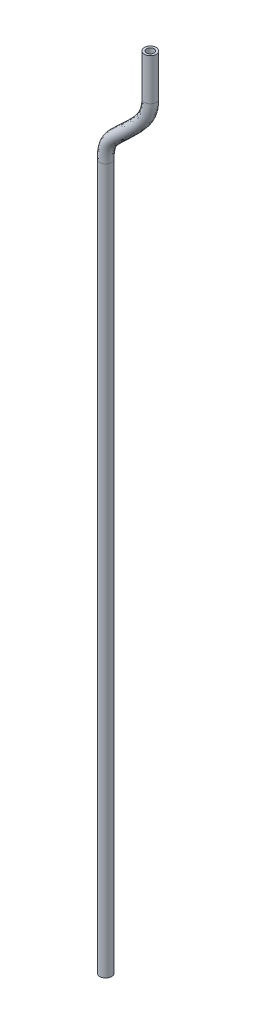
ISO-10303-21;
HEADER;
FILE_DESCRIPTION(('STEP AP214'),'2;1');
FILE_NAME('part.step','',(''),(''),'','','');
FILE_SCHEMA(('AUTOMOTIVE_DESIGN { 1 0 10303 214 1 1 1 1 }'));
ENDSEC;
DATA;
#1=APPLICATION_CONTEXT('core data for automotive mechanical design processes');
#2=APPLICATION_PROTOCOL_DEFINITION('international standard','automotive_design',2000,#1);
#3=PRODUCT_CONTEXT('',#1,'mechanical');
#4=PRODUCT('Part','Part','',(#3));
#5=PRODUCT_RELATED_PRODUCT_CATEGORY('part','',(#4));
#6=PRODUCT_DEFINITION_FORMATION('','',#4);
#7=PRODUCT_DEFINITION_CONTEXT('part definition',#1,'design');
#8=PRODUCT_DEFINITION('design','',#6,#7);
#9=PRODUCT_DEFINITION_SHAPE('','',#8);
#10=(LENGTH_UNIT() NAMED_UNIT(*) SI_UNIT(.MILLI.,.METRE.));
#11=(NAMED_UNIT(*) PLANE_ANGLE_UNIT() SI_UNIT($,.RADIAN.));
#12=(NAMED_UNIT(*) SI_UNIT($,.STERADIAN.) SOLID_ANGLE_UNIT());
#13=UNCERTAINTY_MEASURE_WITH_UNIT(LENGTH_MEASURE(1.E-05),#10,'distance_accuracy_value','');
#14=(GEOMETRIC_REPRESENTATION_CONTEXT(3) GLOBAL_UNCERTAINTY_ASSIGNED_CONTEXT((#13)) GLOBAL_UNIT_ASSIGNED_CONTEXT((#10,
#11,#12)) REPRESENTATION_CONTEXT('',''));
#15=CARTESIAN_POINT('',(0.,0.,0.));
#16=DIRECTION('',(0.,0.,1.));
#17=DIRECTION('',(1.,0.,0.));
#18=AXIS2_PLACEMENT_3D('',#15,#16,#17);
#19=CARTESIAN_POINT('',(18.,-24.,0.));
#20=DIRECTION('',(0.,1.,0.));
#21=DIRECTION('',(1.,0.,0.));
#22=AXIS2_PLACEMENT_3D('',#19,#20,#21);
#23=PLANE('',#22);
#24=CARTESIAN_POINT('',(18.,-24.,0.));
#25=DIRECTION('',(0.,1.,0.));
#26=DIRECTION('',(0.,0.,1.));
#27=AXIS2_PLACEMENT_3D('',#24,#25,#26);
#28=CIRCLE('',#27,1.25);
#29=CARTESIAN_POINT('',(18.,-24.,1.25));
#30=VERTEX_POINT('',#29);
#31=EDGE_CURVE('E10',#30,#30,#28,.T.);
#32=ORIENTED_EDGE('',*,*,#31,.F.);
#33=EDGE_LOOP('',(#32));
#34=FACE_BOUND('',#33,.T.);
#35=CARTESIAN_POINT('',(18.,-24.,0.));
#36=DIRECTION('',(0.,1.,0.));
#37=DIRECTION('',(0.,0.,1.));
#38=AXIS2_PLACEMENT_3D('',#35,#36,#37);
#39=CIRCLE('',#38,2.);
#40=CARTESIAN_POINT('',(18.,-24.,2.));
#41=VERTEX_POINT('',#40);
#42=EDGE_CURVE('E111',#41,#41,#39,.T.);
#43=ORIENTED_EDGE('',*,*,#42,.T.);
#44=EDGE_LOOP('',(#43));
#45=FACE_BOUND('',#44,.T.);
#46=ADVANCED_FACE('F16',(#34,#45),#23,.T.);
#47=CARTESIAN_POINT('',(18.,-29.7,0.));
#48=DIRECTION('',(0.,1.,0.));
#49=DIRECTION('',(0.,0.,1.));
#50=AXIS2_PLACEMENT_3D('',#47,#48,#49);
#51=CYLINDRICAL_SURFACE('',#50,1.25);
#52=DIRECTION('',(0.,1.,0.));
#53=VECTOR('',#52,1.);
#54=CARTESIAN_POINT('',(18.,-29.7,1.25));
#55=LINE('',#54,#53);
#56=CARTESIAN_POINT('',(18.,-29.5,1.25));
#57=VERTEX_POINT('',#56);
#58=EDGE_CURVE('E114',#57,#30,#55,.T.);
#59=ORIENTED_EDGE('',*,*,#58,.F.);
#60=CARTESIAN_POINT('',(18.,-29.5,0.));
#61=DIRECTION('',(0.,-1.,0.));
#62=DIRECTION('',(1.,0.,0.));
#63=AXIS2_PLACEMENT_3D('',#60,#61,#62);
#64=CIRCLE('',#63,1.25);
#65=CARTESIAN_POINT('',(19.25,-29.5,0.));
#66=VERTEX_POINT('',#65);
#67=EDGE_CURVE('E120',#66,#57,#64,.T.);
#68=ORIENTED_EDGE('',*,*,#67,.F.);
#69=DIRECTION('',(0.,1.,0.));
#70=VECTOR('',#69,1.);
#71=CARTESIAN_POINT('',(19.25,-38.,0.));
#72=LINE('',#71,#70);
#73=CARTESIAN_POINT('',(19.25,-38.,0.));
#74=VERTEX_POINT('',#73);
#75=EDGE_CURVE('E26',#74,#66,#72,.T.);
#76=ORIENTED_EDGE('',*,*,#75,.F.);
#77=CARTESIAN_POINT('',(18.,-38.,0.));
#78=DIRECTION('',(0.,-1.,0.));
#79=DIRECTION('',(1.,0.,0.));
#80=AXIS2_PLACEMENT_3D('',#77,#78,#79);
#81=CIRCLE('',#80,1.25);
#82=EDGE_CURVE('E112',#74,#74,#81,.T.);
#83=ORIENTED_EDGE('',*,*,#82,.T.);
#84=ORIENTED_EDGE('',*,*,#75,.T.);
#85=ORIENTED_EDGE('',*,*,#67,.T.);
#86=ORIENTED_EDGE('',*,*,#58,.T.);
#87=ORIENTED_EDGE('',*,*,#31,.T.);
#88=EDGE_LOOP('',(#59,#68,#76,#83,#84,#85,#86,#87));
#89=FACE_BOUND('',#88,.T.);
#90=ADVANCED_FACE('F184',(#89),#51,.F.);
#91=CARTESIAN_POINT('',(19.25,-38.,0.));
#92=CARTESIAN_POINT('',(19.25,-39.04061917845,0.));
#93=CARTESIAN_POINT('',(19.176588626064,-40.02053076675,0.));
#94=CARTESIAN_POINT('',(19.032744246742,-40.94499559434,0.));
#95=CARTESIAN_POINT('',(18.821214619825,-41.81850319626,0.));
#96=CARTESIAN_POINT('',(18.546278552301,-42.64317702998,0.));
#97=CARTESIAN_POINT('',(18.214390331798,-43.42062925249,0.));
#98=CARTESIAN_POINT('',(17.833687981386,-44.15416323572,0.));
#99=CARTESIAN_POINT('',(17.412683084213,-44.84960289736,0.));
#100=CARTESIAN_POINT('',(16.958786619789,-45.51440882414,0.));
#101=CARTESIAN_POINT('',(16.477661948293,-46.15612206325,0.));
#102=CARTESIAN_POINT('',(15.494803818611,-47.38034418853,0.));
#103=CARTESIAN_POINT('',(14.991513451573,-47.96858507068,0.));
#104=CARTESIAN_POINT('',(14.468585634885,-48.54782070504,0.));
#105=CARTESIAN_POINT('',(13.929660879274,-49.11842642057,0.));
#106=CARTESIAN_POINT('',(13.378336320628,-49.68064294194,0.));
#107=CARTESIAN_POINT('',(12.818198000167,-50.23460058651,0.));
#108=CARTESIAN_POINT('',(12.252845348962,-50.78033689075,0.));
#109=CARTESIAN_POINT('',(11.685907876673,-51.31780766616,0.));
#110=CARTESIAN_POINT('',(11.121054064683,-51.84689148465,0.));
#111=CARTESIAN_POINT('',(10.248312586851,-52.65942903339,0.));
#112=CARTESIAN_POINT('',(9.398805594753,-53.45033487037,0.));
#113=CARTESIAN_POINT('',(9.09713964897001,-53.7317529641,0.));
#114=CARTESIAN_POINT('',(8.799803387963,-54.01026278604,0.));
#115=CARTESIAN_POINT('',(8.50746884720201,-54.28579566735,0.));
#116=CARTESIAN_POINT('',(8.22081366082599,-54.55827085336,0.));
#117=CARTESIAN_POINT('',(7.940521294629,-54.82759231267,0.));
#118=CARTESIAN_POINT('',(7.667281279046,-55.09364554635,0.));
#119=CARTESIAN_POINT('',(7.40178944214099,-55.35629439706,0.));
#120=CARTESIAN_POINT('',(7.14474814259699,-55.61537785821,0.));
#121=CARTESIAN_POINT('',(6.433902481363,-56.34758024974,0.));
#122=CARTESIAN_POINT('',(6.016460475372,-56.79737856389,0.));
#123=CARTESIAN_POINT('',(5.649418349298,-57.23577662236,0.));
#124=CARTESIAN_POINT('',(5.331330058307,-57.67812289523,0.));
#125=CARTESIAN_POINT('',(5.066042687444,-58.1446807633,0.));
#126=CARTESIAN_POINT('',(4.823251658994,-58.6454171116,0.));
#127=CARTESIAN_POINT('',(4.607635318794,-59.25210226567,0.));
#128=CARTESIAN_POINT('',(4.436594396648,-59.96802918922,0.));
#129=CARTESIAN_POINT('',(4.314343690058,-60.8207659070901,0.));
#130=CARTESIAN_POINT('',(4.25,-61.8258066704,0.));
#131=CARTESIAN_POINT('',(4.25,-63.,0.));
#132=CARTESIAN_POINT('',(19.25,-38.,-2.076928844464));
#133=CARTESIAN_POINT('',(19.25,-39.04061917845,-2.076928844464));
#134=CARTESIAN_POINT('',(19.176588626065,-40.02053076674,-2.076928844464));
#135=CARTESIAN_POINT('',(19.032744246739,-40.94499559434,-2.076928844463));
#136=CARTESIAN_POINT('',(18.821214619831,-41.81850319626,-2.076928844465));
#137=CARTESIAN_POINT('',(18.546278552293,-42.64317702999,-2.076928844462));
#138=CARTESIAN_POINT('',(18.214390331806,-43.42062925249,-2.076928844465));
#139=CARTESIAN_POINT('',(17.833687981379,-44.15416323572,-2.076928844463));
#140=CARTESIAN_POINT('',(17.412683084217,-44.84960289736,-2.076928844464));
#141=CARTESIAN_POINT('',(16.958786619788,-45.51440882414,-2.076928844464));
#142=CARTESIAN_POINT('',(16.477661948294,-46.1561220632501,-2.076928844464));
#143=CARTESIAN_POINT('',(15.494803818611,-47.38034418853,-2.076928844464));
#144=CARTESIAN_POINT('',(14.991513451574,-47.96858507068,-2.076928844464));
#145=CARTESIAN_POINT('',(14.468585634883,-48.54782070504,-2.076928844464));
#146=CARTESIAN_POINT('',(13.929660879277,-49.11842642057,-2.076928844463));
#147=CARTESIAN_POINT('',(13.378336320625,-49.68064294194,-2.076928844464));
#148=CARTESIAN_POINT('',(12.81819800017,-50.23460058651,-2.076928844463));
#149=CARTESIAN_POINT('',(12.25284534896,-50.78033689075,-2.076928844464));
#150=CARTESIAN_POINT('',(11.685907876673,-51.31780766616,-2.076928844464));
#151=CARTESIAN_POINT('',(11.121054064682,-51.84689148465,-2.076928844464));
#152=CARTESIAN_POINT('',(10.248312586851,-52.65942903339,-2.076928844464));
#153=CARTESIAN_POINT('',(9.398805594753,-53.45033487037,-2.076928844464));
#154=CARTESIAN_POINT('',(9.09713964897,-53.7317529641,-2.076928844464));
#155=CARTESIAN_POINT('',(8.799803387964,-54.01026278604,-2.076928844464));
#156=CARTESIAN_POINT('',(8.507468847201,-54.28579566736,-2.076928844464));
#157=CARTESIAN_POINT('',(8.220813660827,-54.55827085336,-2.076928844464));
#158=CARTESIAN_POINT('',(7.940521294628,-54.82759231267,-2.076928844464));
#159=CARTESIAN_POINT('',(7.667281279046,-55.09364554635,-2.076928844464));
#160=CARTESIAN_POINT('',(7.401789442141,-55.3562943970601,-2.076928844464));
#161=CARTESIAN_POINT('',(7.144748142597,-55.61537785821,-2.076928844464));
#162=CARTESIAN_POINT('',(6.433902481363,-56.34758024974,-2.076928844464));
#163=CARTESIAN_POINT('',(6.016460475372,-56.79737856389,-2.076928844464));
#164=CARTESIAN_POINT('',(5.649418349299,-57.23577662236,-2.076928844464));
#165=CARTESIAN_POINT('',(5.331330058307,-57.67812289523,-2.076928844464));
#166=CARTESIAN_POINT('',(5.066042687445,-58.14468076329,-2.076928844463));
#167=CARTESIAN_POINT('',(4.823251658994,-58.64541711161,-2.076928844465));
#168=CARTESIAN_POINT('',(4.607635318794,-59.25210226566,-2.076928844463));
#169=CARTESIAN_POINT('',(4.43659439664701,-59.96802918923,-2.076928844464));
#170=CARTESIAN_POINT('',(4.314343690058,-60.82076590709,-2.076928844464));
#171=CARTESIAN_POINT('',(4.25,-61.8258066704,-2.076928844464));
#172=CARTESIAN_POINT('',(4.25,-63.,-2.076928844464));
#173=CARTESIAN_POINT('',(16.681814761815,-38.,-2.375140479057));
#174=CARTESIAN_POINT('',(16.681814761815,-38.87591478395,-2.375140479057));
#175=CARTESIAN_POINT('',(16.620022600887,-39.67769308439,-2.375140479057));
#176=CARTESIAN_POINT('',(16.502344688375,-40.4139002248,-2.375140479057));
#177=CARTESIAN_POINT('',(16.334930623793,-41.09391489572,-2.375140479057));
#178=CARTESIAN_POINT('',(16.122315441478,-41.72961093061,-2.375140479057));
#179=CARTESIAN_POINT('',(15.866740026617,-42.33340135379,-2.375140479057));
#180=CARTESIAN_POINT('',(15.568669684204,-42.9159157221,-2.375140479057));
#181=CARTESIAN_POINT('',(15.228175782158,-43.48512555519,-2.375140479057));
#182=CARTESIAN_POINT('',(14.846490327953,-44.04727642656,-2.375140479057));
#183=CARTESIAN_POINT('',(14.426688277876,-44.60852906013,-2.375140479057));
#184=CARTESIAN_POINT('',(13.538295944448,-45.71508708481,-2.375140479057));
#185=CARTESIAN_POINT('',(13.076511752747,-46.25534320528,-2.375140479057));
#186=CARTESIAN_POINT('',(12.590307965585,-46.79455019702,-2.375140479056));
#187=CARTESIAN_POINT('',(12.083335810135,-47.33190873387,-2.375140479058));
#188=CARTESIAN_POINT('',(11.559292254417,-47.8667614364,-2.375140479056));
#189=CARTESIAN_POINT('',(11.021885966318,-48.39856735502,-2.375140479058));
#190=CARTESIAN_POINT('',(10.474811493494,-48.92688338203,-2.375140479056));
#191=CARTESIAN_POINT('',(9.92173166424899,-49.45135259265,-2.375140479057));
#192=CARTESIAN_POINT('',(9.366268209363,-49.97169951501,-2.375140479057));
#193=CARTESIAN_POINT('',(8.501010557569,-50.77726949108,-2.375140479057));
#194=CARTESIAN_POINT('',(7.647304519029,-51.57208471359,-2.375140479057));
#195=CARTESIAN_POINT('',(7.342584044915,-51.85635283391,-2.375140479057));
#196=CARTESIAN_POINT('',(7.04060130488,-52.13920913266,-2.375140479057));
#197=CARTESIAN_POINT('',(6.741970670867,-52.42065474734,-2.375140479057));
#198=CARTESIAN_POINT('',(6.447300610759,-52.70070356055,-2.375140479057));
#199=CARTESIAN_POINT('',(6.15719344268,-52.97938556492,-2.375140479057));
#200=CARTESIAN_POINT('',(5.87224508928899,-53.2567502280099,-2.375140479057));
#201=CARTESIAN_POINT('',(5.5930448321,-53.53286985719,-2.375140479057));
#202=CARTESIAN_POINT('',(5.320175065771,-53.80784296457,-2.375140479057));
#203=CARTESIAN_POINT('',(4.557474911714,-54.59345777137,-2.375140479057));
#204=CARTESIAN_POINT('',(4.070516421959,-55.11630656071,-2.375140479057));
#205=CARTESIAN_POINT('',(3.597238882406,-55.67157998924,-2.375140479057));
#206=CARTESIAN_POINT('',(3.148214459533,-56.2808581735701,-2.375140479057));
#207=CARTESIAN_POINT('',(2.728433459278,-56.96053822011,-2.375140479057));
#208=CARTESIAN_POINT('',(2.378900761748,-57.73787538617,-2.375140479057));
#209=CARTESIAN_POINT('',(2.103730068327,-58.5749502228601,-2.375140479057));
#210=CARTESIAN_POINT('',(1.893618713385,-59.50605595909,-2.375140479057));
#211=CARTESIAN_POINT('',(1.753169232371,-60.53988660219,-2.375140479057));
#212=CARTESIAN_POINT('',(1.681814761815,-61.69786853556,-2.375140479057));
#213=CARTESIAN_POINT('',(1.681814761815,-63.,-2.375140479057));
#214=CARTESIAN_POINT('',(14.563603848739,-38.,0.));
#215=CARTESIAN_POINT('',(14.563603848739,-38.74006841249,0.));
#216=CARTESIAN_POINT('',(14.511395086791,-39.39492433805,0.));
#217=CARTESIAN_POINT('',(14.41529898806,-39.97585861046,0.));
#218=CARTESIAN_POINT('',(14.284270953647,-40.49628244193,0.));
#219=CARTESIAN_POINT('',(14.123057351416,-40.97611166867,0.));
#220=CARTESIAN_POINT('',(13.930423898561,-41.43666775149,0.));
#221=CARTESIAN_POINT('',(13.700507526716,-41.89462280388,0.));
#222=CARTESIAN_POINT('',(13.426418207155,-42.35971966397,0.));
#223=CARTESIAN_POINT('',(13.10429159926,-42.83720177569,0.));
#224=CARTESIAN_POINT('',(12.73506777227,-43.33209138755,0.));
#225=CARTESIAN_POINT('',(11.924589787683,-44.34160135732,0.));
#226=CARTESIAN_POINT('',(11.497039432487,-44.84228017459,0.));
#227=CARTESIAN_POINT('',(11.041125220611,-45.34847198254,0.));
#228=CARTESIAN_POINT('',(10.560507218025,-45.85840861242,0.));
#229=CARTESIAN_POINT('',(10.05896473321,-46.3706919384,0.));
#230=CARTESIAN_POINT('',(9.540307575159,-46.88422735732,0.));
#231=CARTESIAN_POINT('',(9.00830874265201,-47.39817533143,0.));
#232=CARTESIAN_POINT('',(8.466658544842,-47.91192099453,0.));
#233=CARTESIAN_POINT('',(7.918940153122,-48.42506182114,0.));
#234=CARTESIAN_POINT('',(7.05985507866,-49.22488501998,0.));
#235=CARTESIAN_POINT('',(6.202685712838,-50.02292466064,0.));
#236=CARTESIAN_POINT('',(5.89544589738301,-50.30954345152,0.));
#237=CARTESIAN_POINT('',(5.589630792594,-50.5959846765,0.));
#238=CARTESIAN_POINT('',(5.285807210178,-50.88230704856,0.));
#239=CARTESIAN_POINT('',(4.984526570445,-51.16860250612,0.));
#240=CARTESIAN_POINT('',(4.686324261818,-51.45500498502,0.));
#241=CARTESIAN_POINT('',(4.391719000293,-51.74169919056,0.));
#242=CARTESIAN_POINT('',(4.10121218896,-52.02892936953,0.));
#243=CARTESIAN_POINT('',(3.815287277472,-52.3170080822,0.));
#244=CARTESIAN_POINT('',(3.009818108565,-53.14667686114,0.));
#245=CARTESIAN_POINT('',(2.46552318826,-53.72977687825,0.));
#246=CARTESIAN_POINT('',(1.904623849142,-54.3814478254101,0.));
#247=CARTESIAN_POINT('',(1.347604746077,-55.1284096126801,0.));
#248=CARTESIAN_POINT('',(0.800399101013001,-55.98387048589,0.));
#249=CARTESIAN_POINT('',(0.362827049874,-56.98934496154,0.));
#250=CARTESIAN_POINT('',(0.03853658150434,-58.01644267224,0.));
#251=CARTESIAN_POINT('',(-0.203799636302,-59.12502552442,0.));
#252=CARTESIAN_POINT('',(-0.359259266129,-60.30822044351,0.));
#253=CARTESIAN_POINT('',(-0.436396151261,-61.59234657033,0.));
#254=CARTESIAN_POINT('',(-0.436396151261,-63.,0.));
#255=CARTESIAN_POINT('',(16.681814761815,-38.,2.375140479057));
#256=CARTESIAN_POINT('',(16.681814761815,-38.87591478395,2.375140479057));
#257=CARTESIAN_POINT('',(16.620022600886,-39.67769308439,2.375140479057));
#258=CARTESIAN_POINT('',(16.502344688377,-40.4139002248,2.375140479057));
#259=CARTESIAN_POINT('',(16.33493062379,-41.09391489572,2.375140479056));
#260=CARTESIAN_POINT('',(16.122315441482,-41.72961093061,2.375140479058));
#261=CARTESIAN_POINT('',(15.866740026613,-42.33340135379,2.375140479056));
#262=CARTESIAN_POINT('',(15.568669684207,-42.9159157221,2.375140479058));
#263=CARTESIAN_POINT('',(15.228175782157,-43.4851255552,2.375140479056));
#264=CARTESIAN_POINT('',(14.846490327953,-44.04727642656,2.375140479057));
#265=CARTESIAN_POINT('',(14.426688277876,-44.60852906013,2.375140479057));
#266=CARTESIAN_POINT('',(13.538295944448,-45.71508708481,2.375140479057));
#267=CARTESIAN_POINT('',(13.076511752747,-46.25534320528,2.375140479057));
#268=CARTESIAN_POINT('',(12.590307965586,-46.79455019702,2.375140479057));
#269=CARTESIAN_POINT('',(12.083335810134,-47.33190873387,2.375140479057));
#270=CARTESIAN_POINT('',(11.559292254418,-47.8667614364,2.375140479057));
#271=CARTESIAN_POINT('',(11.021885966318,-48.39856735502,2.375140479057));
#272=CARTESIAN_POINT('',(10.474811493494,-48.92688338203,2.375140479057));
#273=CARTESIAN_POINT('',(9.92173166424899,-49.45135259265,2.375140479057));
#274=CARTESIAN_POINT('',(9.366268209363,-49.97169951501,2.375140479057));
#275=CARTESIAN_POINT('',(8.501010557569,-50.77726949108,2.375140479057));
#276=CARTESIAN_POINT('',(7.647304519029,-51.57208471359,2.375140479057));
#277=CARTESIAN_POINT('',(7.342584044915,-51.85635283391,2.375140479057));
#278=CARTESIAN_POINT('',(7.04060130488,-52.13920913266,2.375140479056));
#279=CARTESIAN_POINT('',(6.741970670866,-52.42065474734,2.375140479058));
#280=CARTESIAN_POINT('',(6.44730061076,-52.70070356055,2.375140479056));
#281=CARTESIAN_POINT('',(6.157193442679,-52.97938556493,2.375140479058));
#282=CARTESIAN_POINT('',(5.87224508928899,-53.2567502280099,2.375140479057));
#283=CARTESIAN_POINT('',(5.5930448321,-53.53286985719,2.375140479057));
#284=CARTESIAN_POINT('',(5.32017506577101,-53.80784296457,2.375140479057));
#285=CARTESIAN_POINT('',(4.557474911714,-54.59345777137,2.375140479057));
#286=CARTESIAN_POINT('',(4.07051642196,-55.11630656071,2.375140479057));
#287=CARTESIAN_POINT('',(3.597238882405,-55.67157998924,2.375140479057));
#288=CARTESIAN_POINT('',(3.148214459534,-56.2808581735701,2.375140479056));
#289=CARTESIAN_POINT('',(2.728433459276,-56.96053822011,2.375140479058));
#290=CARTESIAN_POINT('',(2.37890076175,-57.73787538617,2.375140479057));
#291=CARTESIAN_POINT('',(2.103730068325,-58.5749502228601,2.375140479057));
#292=CARTESIAN_POINT('',(1.893618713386,-59.50605595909,2.375140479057));
#293=CARTESIAN_POINT('',(1.75316923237,-60.53988660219,2.375140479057));
#294=CARTESIAN_POINT('',(1.681814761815,-61.69786853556,2.375140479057));
#295=CARTESIAN_POINT('',(1.681814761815,-63.,2.375140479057));
#296=CARTESIAN_POINT('',(19.25,-38.,2.076928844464));
#297=CARTESIAN_POINT('',(19.25,-39.04061917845,2.076928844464));
#298=CARTESIAN_POINT('',(19.176588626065,-40.02053076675,2.076928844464));
#299=CARTESIAN_POINT('',(19.032744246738,-40.94499559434,2.076928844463));
#300=CARTESIAN_POINT('',(18.821214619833,-41.81850319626,2.076928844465));
#301=CARTESIAN_POINT('',(18.546278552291,-42.64317702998,2.076928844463));
#302=CARTESIAN_POINT('',(18.214390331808,-43.42062925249,2.076928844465));
#303=CARTESIAN_POINT('',(17.833687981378,-44.15416323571,2.076928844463));
#304=CARTESIAN_POINT('',(17.412683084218,-44.84960289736,2.076928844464));
#305=CARTESIAN_POINT('',(16.958786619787,-45.51440882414,2.076928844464));
#306=CARTESIAN_POINT('',(16.477661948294,-46.1561220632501,2.076928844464));
#307=CARTESIAN_POINT('',(15.494803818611,-47.38034418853,2.076928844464));
#308=CARTESIAN_POINT('',(14.991513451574,-47.96858507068,2.076928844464));
#309=CARTESIAN_POINT('',(14.468585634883,-48.54782070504,2.076928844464));
#310=CARTESIAN_POINT('',(13.929660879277,-49.11842642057,2.076928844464));
#311=CARTESIAN_POINT('',(13.378336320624,-49.68064294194,2.076928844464));
#312=CARTESIAN_POINT('',(12.818198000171,-50.23460058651,2.076928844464));
#313=CARTESIAN_POINT('',(12.25284534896,-50.78033689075,2.076928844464));
#314=CARTESIAN_POINT('',(11.685907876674,-51.31780766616,2.076928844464));
#315=CARTESIAN_POINT('',(11.121054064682,-51.84689148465,2.076928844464));
#316=CARTESIAN_POINT('',(10.248312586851,-52.65942903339,2.076928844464));
#317=CARTESIAN_POINT('',(9.398805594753,-53.45033487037,2.076928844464));
#318=CARTESIAN_POINT('',(9.09713964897,-53.7317529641,2.076928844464));
#319=CARTESIAN_POINT('',(8.799803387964,-54.01026278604,2.076928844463));
#320=CARTESIAN_POINT('',(8.507468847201,-54.28579566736,2.076928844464));
#321=CARTESIAN_POINT('',(8.22081366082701,-54.55827085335,2.076928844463));
#322=CARTESIAN_POINT('',(7.940521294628,-54.82759231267,2.076928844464));
#323=CARTESIAN_POINT('',(7.667281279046,-55.09364554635,2.076928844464));
#324=CARTESIAN_POINT('',(7.401789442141,-55.3562943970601,2.076928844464));
#325=CARTESIAN_POINT('',(7.144748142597,-55.61537785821,2.076928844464));
#326=CARTESIAN_POINT('',(6.433902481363,-56.34758024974,2.076928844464));
#327=CARTESIAN_POINT('',(6.016460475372,-56.79737856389,2.076928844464));
#328=CARTESIAN_POINT('',(5.649418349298,-57.23577662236,2.076928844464));
#329=CARTESIAN_POINT('',(5.331330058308,-57.67812289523,2.076928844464));
#330=CARTESIAN_POINT('',(5.066042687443,-58.14468076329,2.076928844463));
#331=CARTESIAN_POINT('',(4.823251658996,-58.64541711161,2.076928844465));
#332=CARTESIAN_POINT('',(4.607635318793,-59.25210226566,2.076928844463));
#333=CARTESIAN_POINT('',(4.436594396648,-59.96802918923,2.076928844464));
#334=CARTESIAN_POINT('',(4.314343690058,-60.82076590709,2.076928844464));
#335=CARTESIAN_POINT('',(4.25,-61.8258066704,2.076928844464));
#336=CARTESIAN_POINT('',(4.25,-63.,2.076928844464));
#337=CARTESIAN_POINT('',(19.25,-38.,0.));
#338=CARTESIAN_POINT('',(19.25,-39.04061917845,0.));
#339=CARTESIAN_POINT('',(19.176588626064,-40.02053076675,0.));
#340=CARTESIAN_POINT('',(19.032744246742,-40.94499559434,0.));
#341=CARTESIAN_POINT('',(18.821214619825,-41.81850319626,0.));
#342=CARTESIAN_POINT('',(18.546278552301,-42.64317702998,0.));
#343=CARTESIAN_POINT('',(18.214390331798,-43.42062925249,0.));
#344=CARTESIAN_POINT('',(17.833687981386,-44.15416323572,0.));
#345=CARTESIAN_POINT('',(17.412683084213,-44.84960289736,0.));
#346=CARTESIAN_POINT('',(16.958786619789,-45.51440882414,0.));
#347=CARTESIAN_POINT('',(16.477661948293,-46.15612206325,0.));
#348=CARTESIAN_POINT('',(15.494803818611,-47.38034418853,0.));
#349=CARTESIAN_POINT('',(14.991513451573,-47.96858507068,0.));
#350=CARTESIAN_POINT('',(14.468585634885,-48.54782070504,0.));
#351=CARTESIAN_POINT('',(13.929660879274,-49.11842642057,0.));
#352=CARTESIAN_POINT('',(13.378336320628,-49.68064294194,0.));
#353=CARTESIAN_POINT('',(12.818198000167,-50.23460058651,0.));
#354=CARTESIAN_POINT('',(12.252845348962,-50.78033689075,0.));
#355=CARTESIAN_POINT('',(11.685907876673,-51.31780766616,0.));
#356=CARTESIAN_POINT('',(11.121054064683,-51.84689148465,0.));
#357=CARTESIAN_POINT('',(10.248312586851,-52.65942903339,0.));
#358=CARTESIAN_POINT('',(9.398805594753,-53.45033487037,0.));
#359=CARTESIAN_POINT('',(9.09713964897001,-53.7317529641,0.));
#360=CARTESIAN_POINT('',(8.799803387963,-54.01026278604,0.));
#361=CARTESIAN_POINT('',(8.50746884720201,-54.28579566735,0.));
#362=CARTESIAN_POINT('',(8.22081366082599,-54.55827085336,0.));
#363=CARTESIAN_POINT('',(7.940521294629,-54.82759231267,0.));
#364=CARTESIAN_POINT('',(7.667281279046,-55.09364554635,0.));
#365=CARTESIAN_POINT('',(7.40178944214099,-55.35629439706,0.));
#366=CARTESIAN_POINT('',(7.14474814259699,-55.61537785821,0.));
#367=CARTESIAN_POINT('',(6.433902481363,-56.34758024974,0.));
#368=CARTESIAN_POINT('',(6.016460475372,-56.79737856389,0.));
#369=CARTESIAN_POINT('',(5.649418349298,-57.23577662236,0.));
#370=CARTESIAN_POINT('',(5.331330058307,-57.67812289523,0.));
#371=CARTESIAN_POINT('',(5.066042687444,-58.1446807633,0.));
#372=CARTESIAN_POINT('',(4.823251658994,-58.6454171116,0.));
#373=CARTESIAN_POINT('',(4.607635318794,-59.25210226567,0.));
#374=CARTESIAN_POINT('',(4.436594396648,-59.96802918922,0.));
#375=CARTESIAN_POINT('',(4.314343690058,-60.8207659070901,0.));
#376=CARTESIAN_POINT('',(4.25,-61.8258066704,0.));
#377=CARTESIAN_POINT('',(4.25,-63.,0.));
#378=(BOUNDED_SURFACE() B_SPLINE_SURFACE(6,11,((#91,#92,#93,#94,#95,#96,#97,#98,#99,#100,#101,
#102,#103,#104,#105,#106,#107,#108,#109,#110,#111,#112,#113,#114,#115,#116,#117,#118,#119,#120,
#121,#122,#123,#124,#125,#126,#127,#128,#129,#130,#131),(#132,#133,#134,#135,#136,#137,#138,
#139,#140,#141,#142,#143,#144,#145,#146,#147,#148,#149,#150,#151,#152,#153,#154,#155,#156,#157,
#158,#159,#160,#161,#162,#163,#164,#165,#166,#167,#168,#169,#170,#171,#172),(#173,#174,#175,
#176,#177,#178,#179,#180,#181,#182,#183,#184,#185,#186,#187,#188,#189,#190,#191,#192,#193,#194,
#195,#196,#197,#198,#199,#200,#201,#202,#203,#204,#205,#206,#207,#208,#209,#210,#211,#212,#213),
(#214,#215,#216,#217,#218,#219,#220,#221,#222,#223,#224,#225,#226,#227,#228,#229,#230,#231,#232,
#233,#234,#235,#236,#237,#238,#239,#240,#241,#242,#243,#244,#245,#246,#247,#248,#249,#250,#251,
#252,#253,#254),(#255,#256,#257,#258,#259,#260,#261,#262,#263,#264,#265,#266,#267,#268,#269,
#270,#271,#272,#273,#274,#275,#276,#277,#278,#279,#280,#281,#282,#283,#284,#285,#286,#287,#288,
#289,#290,#291,#292,#293,#294,#295),(#296,#297,#298,#299,#300,#301,#302,#303,#304,#305,#306,
#307,#308,#309,#310,#311,#312,#313,#314,#315,#316,#317,#318,#319,#320,#321,#322,#323,#324,#325,
#326,#327,#328,#329,#330,#331,#332,#333,#334,#335,#336),(#337,#338,#339,#340,#341,#342,#343,
#344,#345,#346,#347,#348,#349,#350,#351,#352,#353,#354,#355,#356,#357,#358,#359,#360,#361,#362,
#363,#364,#365,#366,#367,#368,#369,#370,#371,#372,#373,#374,#375,#376,#377)),.UNSPECIFIED.,.T.,
.F.,.F.) B_SPLINE_SURFACE_WITH_KNOTS((7,7),(12,10,9,10,12),(0.,6.28318530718),(0.,
8.544003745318,16.697268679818,21.271925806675,29.815929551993),
.UNSPECIFIED.) GEOMETRIC_REPRESENTATION_ITEM() RATIONAL_B_SPLINE_SURFACE(((1.669078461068,
1.669078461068,1.669078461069,1.669078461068,1.669078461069,1.669078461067,1.669078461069,
1.669078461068,1.669078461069,1.669078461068,1.669078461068,1.669078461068,1.669078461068,
1.669078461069,1.669078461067,1.66907846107,1.669078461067,1.669078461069,1.669078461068,
1.669078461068,1.669078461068,1.669078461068,1.669078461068,1.669078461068,1.669078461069,
1.669078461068,1.669078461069,1.669078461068,1.669078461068,1.669078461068,1.669078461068,
1.669078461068,1.669078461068,1.669078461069,1.669078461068,1.669078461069,1.669078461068,
1.669078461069,1.669078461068,1.669078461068,1.669078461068),(1.03672962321,1.03672962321,
1.03672962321,1.036729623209,1.03672962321,1.036729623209,1.03672962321,1.036729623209,
1.03672962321,1.03672962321,1.03672962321,1.03672962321,1.036729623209,1.03672962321,
1.036729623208,1.036729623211,1.036729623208,1.036729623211,1.036729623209,1.03672962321,
1.03672962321,1.03672962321,1.03672962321,1.03672962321,1.03672962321,1.03672962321,
1.03672962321,1.03672962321,1.03672962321,1.03672962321,1.03672962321,1.03672962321,
1.03672962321,1.03672962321,1.03672962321,1.036729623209,1.03672962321,1.036729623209,
1.03672962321,1.03672962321,1.03672962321),(1.038346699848,1.038346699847,1.038346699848,
1.038346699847,1.038346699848,1.038346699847,1.038346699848,1.038346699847,1.038346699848,
1.038346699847,1.038346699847,1.038346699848,1.038346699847,1.038346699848,1.038346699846,
1.038346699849,1.038346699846,1.038346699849,1.038346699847,1.038346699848,1.038346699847,
1.038346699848,1.038346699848,1.038346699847,1.038346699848,1.038346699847,1.038346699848,
1.038346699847,1.038346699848,1.038346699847,1.038346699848,1.038346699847,1.038346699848,
1.038346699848,1.038346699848,1.038346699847,1.038346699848,1.038346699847,1.038346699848,
1.038346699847,1.038346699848),(0.853534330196,0.853534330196,0.853534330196,0.853534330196,
0.853534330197,0.853534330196,0.853534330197,0.853534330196,0.853534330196,0.853534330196,
0.853534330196,0.853534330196,0.853534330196,0.853534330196,0.853534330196,0.853534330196,
0.853534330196,0.853534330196,0.853534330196,0.853534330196,0.853534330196,0.853534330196,
0.853534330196,0.853534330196,0.853534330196,0.853534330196,0.853534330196,0.853534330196,
0.853534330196,0.853534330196,0.853534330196,0.853534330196,0.853534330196,0.853534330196,
0.853534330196,0.853534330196,0.853534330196,0.853534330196,0.853534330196,0.853534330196,
0.853534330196),(1.038346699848,1.038346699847,1.038346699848,1.038346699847,1.038346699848,
1.038346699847,1.038346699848,1.038346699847,1.038346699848,1.038346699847,1.038346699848,
1.038346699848,1.038346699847,1.038346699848,1.038346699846,1.038346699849,1.038346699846,
1.038346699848,1.038346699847,1.038346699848,1.038346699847,1.038346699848,1.038346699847,
1.038346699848,1.038346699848,1.038346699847,1.038346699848,1.038346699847,1.038346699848,
1.038346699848,1.038346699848,1.038346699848,1.038346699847,1.038346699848,1.038346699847,
1.038346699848,1.038346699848,1.038346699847,1.038346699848,1.038346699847,1.038346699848),
(1.03672962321,1.03672962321,1.03672962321,1.036729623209,1.03672962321,1.036729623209,
1.03672962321,1.036729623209,1.03672962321,1.03672962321,1.03672962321,1.03672962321,
1.036729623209,1.03672962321,1.036729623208,1.036729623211,1.036729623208,1.036729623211,
1.036729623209,1.03672962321,1.03672962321,1.03672962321,1.03672962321,1.03672962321,
1.03672962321,1.036729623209,1.03672962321,1.036729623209,1.03672962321,1.03672962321,
1.03672962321,1.03672962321,1.03672962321,1.036729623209,1.03672962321,1.036729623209,
1.03672962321,1.036729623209,1.03672962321,1.03672962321,1.03672962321),(1.669078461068,
1.669078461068,1.669078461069,1.669078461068,1.669078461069,1.669078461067,1.669078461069,
1.669078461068,1.669078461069,1.669078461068,1.669078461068,1.669078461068,1.669078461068,
1.669078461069,1.669078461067,1.66907846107,1.669078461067,1.669078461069,1.669078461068,
1.669078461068,1.669078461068,1.669078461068,1.669078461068,1.669078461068,1.669078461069,
1.669078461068,1.669078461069,1.669078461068,1.669078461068,1.669078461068,1.669078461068,
1.669078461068,1.669078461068,1.669078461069,1.669078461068,1.669078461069,1.669078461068,
1.669078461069,1.669078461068,1.669078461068,1.669078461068))) REPRESENTATION_ITEM('') SURFACE());
#379=CARTESIAN_POINT('',(19.25,-38.,0.));
#380=CARTESIAN_POINT('',(19.25,-39.04061917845,0.));
#381=CARTESIAN_POINT('',(19.176588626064,-40.02053076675,0.));
#382=CARTESIAN_POINT('',(19.032744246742,-40.94499559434,0.));
#383=CARTESIAN_POINT('',(18.821214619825,-41.81850319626,0.));
#384=CARTESIAN_POINT('',(18.546278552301,-42.64317702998,0.));
#385=CARTESIAN_POINT('',(18.214390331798,-43.42062925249,0.));
#386=CARTESIAN_POINT('',(17.833687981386,-44.15416323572,0.));
#387=CARTESIAN_POINT('',(17.412683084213,-44.84960289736,0.));
#388=CARTESIAN_POINT('',(16.958786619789,-45.51440882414,0.));
#389=CARTESIAN_POINT('',(16.477661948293,-46.15612206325,0.));
#390=CARTESIAN_POINT('',(15.494803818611,-47.38034418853,0.));
#391=CARTESIAN_POINT('',(14.991513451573,-47.96858507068,0.));
#392=CARTESIAN_POINT('',(14.468585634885,-48.54782070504,0.));
#393=CARTESIAN_POINT('',(13.929660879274,-49.11842642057,0.));
#394=CARTESIAN_POINT('',(13.378336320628,-49.68064294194,0.));
#395=CARTESIAN_POINT('',(12.818198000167,-50.23460058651,0.));
#396=CARTESIAN_POINT('',(12.252845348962,-50.78033689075,0.));
#397=CARTESIAN_POINT('',(11.685907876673,-51.31780766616,0.));
#398=CARTESIAN_POINT('',(11.121054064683,-51.84689148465,0.));
#399=CARTESIAN_POINT('',(10.248312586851,-52.65942903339,0.));
#400=CARTESIAN_POINT('',(9.398805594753,-53.45033487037,0.));
#401=CARTESIAN_POINT('',(9.09713964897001,-53.7317529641,0.));
#402=CARTESIAN_POINT('',(8.799803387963,-54.01026278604,0.));
#403=CARTESIAN_POINT('',(8.50746884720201,-54.28579566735,0.));
#404=CARTESIAN_POINT('',(8.22081366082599,-54.55827085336,0.));
#405=CARTESIAN_POINT('',(7.940521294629,-54.82759231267,0.));
#406=CARTESIAN_POINT('',(7.667281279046,-55.09364554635,0.));
#407=CARTESIAN_POINT('',(7.40178944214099,-55.35629439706,0.));
#408=CARTESIAN_POINT('',(7.14474814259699,-55.61537785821,0.));
#409=CARTESIAN_POINT('',(6.433902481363,-56.34758024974,0.));
#410=CARTESIAN_POINT('',(6.016460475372,-56.79737856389,0.));
#411=CARTESIAN_POINT('',(5.649418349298,-57.23577662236,0.));
#412=CARTESIAN_POINT('',(5.331330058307,-57.67812289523,0.));
#413=CARTESIAN_POINT('',(5.066042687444,-58.1446807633,0.));
#414=CARTESIAN_POINT('',(4.823251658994,-58.6454171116,0.));
#415=CARTESIAN_POINT('',(4.607635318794,-59.25210226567,0.));
#416=CARTESIAN_POINT('',(4.436594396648,-59.96802918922,0.));
#417=CARTESIAN_POINT('',(4.314343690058,-60.8207659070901,0.));
#418=CARTESIAN_POINT('',(4.25,-61.8258066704,0.));
#419=CARTESIAN_POINT('',(4.25,-63.,0.));
#420=(BOUNDED_CURVE() B_SPLINE_CURVE(11,(#379,#380,#381,#382,#383,#384,#385,#386,#387,#388,#389,
#390,#391,#392,#393,#394,#395,#396,#397,#398,#399,#400,#401,#402,#403,#404,#405,#406,#407,#408,
#409,#410,#411,#412,#413,#414,#415,#416,#417,#418,#419),.UNSPECIFIED.,.F.,
.F.) B_SPLINE_CURVE_WITH_KNOTS((12,10,9,10,12),(0.,8.544003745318,16.697268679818,
21.271925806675,29.815929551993),
.UNSPECIFIED.) CURVE() GEOMETRIC_REPRESENTATION_ITEM() RATIONAL_B_SPLINE_CURVE((1.669078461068,
1.669078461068,1.669078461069,1.669078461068,1.669078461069,1.669078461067,1.669078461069,
1.669078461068,1.669078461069,1.669078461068,1.669078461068,1.669078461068,1.669078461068,
1.669078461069,1.669078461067,1.66907846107,1.669078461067,1.669078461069,1.669078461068,
1.669078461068,1.669078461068,1.669078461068,1.669078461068,1.669078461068,1.669078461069,
1.669078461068,1.669078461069,1.669078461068,1.669078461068,1.669078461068,1.669078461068,
1.669078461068,1.669078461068,1.669078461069,1.669078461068,1.669078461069,1.669078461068,
1.669078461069,1.669078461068,1.669078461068,1.669078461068)) REPRESENTATION_ITEM(''));
#421=CARTESIAN_POINT('',(4.25,-63.,0.));
#422=VERTEX_POINT('',#421);
#423=EDGE_CURVE('E115',#74,#422,#420,.T.);
#424=CARTESIAN_POINT('',(4.25,-63.,0.));
#425=CARTESIAN_POINT('',(4.25,-63.,-2.076928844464));
#426=CARTESIAN_POINT('',(1.681814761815,-63.,-2.375140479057));
#427=CARTESIAN_POINT('',(-0.436396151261,-63.,0.));
#428=CARTESIAN_POINT('',(1.681814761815,-63.,2.375140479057));
#429=CARTESIAN_POINT('',(4.25,-63.,2.076928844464));
#430=CARTESIAN_POINT('',(4.25,-63.,0.));
#431=(BOUNDED_CURVE() B_SPLINE_CURVE(6,(#424,#425,#426,#427,#428,#429,#430),.UNSPECIFIED.,.T.,
.F.) B_SPLINE_CURVE_WITH_KNOTS((7,7),(0.,6.28318530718),
.UNSPECIFIED.) CURVE() GEOMETRIC_REPRESENTATION_ITEM() RATIONAL_B_SPLINE_CURVE((1.669078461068,
1.03672962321,1.038346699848,0.853534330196,1.038346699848,1.03672962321,1.669078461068)) REPRESENTATION_ITEM(''));
#432=EDGE_CURVE('E100',#422,#422,#431,.T.);
#433=ORIENTED_EDGE('',*,*,#423,.T.);
#434=ORIENTED_EDGE('',*,*,#432,.F.);
#435=ORIENTED_EDGE('',*,*,#423,.F.);
#436=ORIENTED_EDGE('',*,*,#82,.F.);
#437=EDGE_LOOP('',(#433,#434,#435,#436));
#438=FACE_BOUND('',#437,.T.);
#439=ADVANCED_FACE('F191',(#438),#378,.T.);
#440=CARTESIAN_POINT('',(3.,-63.,0.));
#441=DIRECTION('',(0.,-1.,0.));
#442=DIRECTION('',(1.,0.,0.));
#443=AXIS2_PLACEMENT_3D('',#440,#441,#442);
#444=CYLINDRICAL_SURFACE('',#443,1.25);
#445=ORIENTED_EDGE('',*,*,#432,.T.);
#446=DIRECTION('',(0.,-1.,0.));
#447=VECTOR('',#446,1.);
#448=CARTESIAN_POINT('',(4.25,-63.,0.));
#449=LINE('',#448,#447);
#450=CARTESIAN_POINT('',(4.25,-300.,0.));
#451=VERTEX_POINT('',#450);
#452=EDGE_CURVE('E123',#422,#451,#449,.T.);
#453=ORIENTED_EDGE('',*,*,#452,.T.);
#454=CARTESIAN_POINT('',(3.,-300.,0.));
#455=DIRECTION('',(0.,-1.,0.));
#456=DIRECTION('',(1.,0.,0.));
#457=AXIS2_PLACEMENT_3D('',#454,#455,#456);
#458=CIRCLE('',#457,1.25);
#459=EDGE_CURVE('E92',#451,#451,#458,.T.);
#460=ORIENTED_EDGE('',*,*,#459,.T.);
#461=ORIENTED_EDGE('',*,*,#452,.F.);
#462=EDGE_LOOP('',(#445,#453,#460,#461));
#463=FACE_BOUND('',#462,.T.);
#464=ADVANCED_FACE('F202',(#463),#444,.F.);
#465=CARTESIAN_POINT('',(3.,-300.,0.));
#466=DIRECTION('',(0.,-1.,0.));
#467=DIRECTION('',(-1.,0.,0.));
#468=AXIS2_PLACEMENT_3D('',#465,#466,#467);
#469=PLANE('',#468);
#470=ORIENTED_EDGE('',*,*,#459,.F.);
#471=EDGE_LOOP('',(#470));
#472=FACE_BOUND('',#471,.T.);
#473=CARTESIAN_POINT('',(3.,-300.,0.));
#474=DIRECTION('',(0.,-1.,0.));
#475=DIRECTION('',(1.,0.,0.));
#476=AXIS2_PLACEMENT_3D('',#473,#474,#475);
#477=CIRCLE('',#476,2.);
#478=CARTESIAN_POINT('',(5.,-300.,0.));
#479=VERTEX_POINT('',#478);
#480=EDGE_CURVE('E87',#479,#479,#477,.T.);
#481=ORIENTED_EDGE('',*,*,#480,.T.);
#482=EDGE_LOOP('',(#481));
#483=FACE_BOUND('',#482,.T.);
#484=ADVANCED_FACE('F88',(#472,#483),#469,.T.);
#485=CARTESIAN_POINT('',(3.,-63.,0.));
#486=DIRECTION('',(0.,-1.,0.));
#487=DIRECTION('',(1.,0.,0.));
#488=AXIS2_PLACEMENT_3D('',#485,#486,#487);
#489=CYLINDRICAL_SURFACE('',#488,2.);
#490=DIRECTION('',(0.,-1.,0.));
#491=VECTOR('',#490,1.);
#492=CARTESIAN_POINT('',(5.,-63.,0.));
#493=LINE('',#492,#491);
#494=CARTESIAN_POINT('',(5.,-63.,0.));
#495=VERTEX_POINT('',#494);
#496=EDGE_CURVE('E93',#495,#479,#493,.T.);
#497=ORIENTED_EDGE('',*,*,#496,.T.);
#498=ORIENTED_EDGE('',*,*,#480,.F.);
#499=ORIENTED_EDGE('',*,*,#496,.F.);
#500=CARTESIAN_POINT('',(5.,-63.,0.));
#501=CARTESIAN_POINT('',(5.,-63.,3.323086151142));
#502=CARTESIAN_POINT('',(0.890903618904,-63.,3.800224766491));
#503=CARTESIAN_POINT('',(-2.498233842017,-63.,0.));
#504=CARTESIAN_POINT('',(0.890903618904,-63.,-3.800224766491));
#505=CARTESIAN_POINT('',(5.,-63.,-3.323086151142));
#506=CARTESIAN_POINT('',(5.,-63.,0.));
#507=(BOUNDED_CURVE() B_SPLINE_CURVE(6,(#500,#501,#502,#503,#504,#505,#506),.UNSPECIFIED.,.T.,
.F.) B_SPLINE_CURVE_WITH_KNOTS((7,7),(0.,6.28318530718),
.UNSPECIFIED.) CURVE() GEOMETRIC_REPRESENTATION_ITEM() RATIONAL_B_SPLINE_CURVE((1.669078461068,
1.03672962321,1.038346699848,0.853534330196,1.038346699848,1.03672962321,1.669078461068)) REPRESENTATION_ITEM(''));
#508=EDGE_CURVE('E103',#495,#495,#507,.T.);
#509=ORIENTED_EDGE('',*,*,#508,.T.);
#510=EDGE_LOOP('',(#497,#498,#499,#509));
#511=FACE_BOUND('',#510,.T.);
#512=ADVANCED_FACE('F18',(#511),#489,.T.);
#513=CARTESIAN_POINT('',(20.,-38.,0.));
#514=CARTESIAN_POINT('',(20.,-39.08871862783,0.));
#515=CARTESIAN_POINT('',(19.923195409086,-40.12065137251,0.));
#516=CARTESIAN_POINT('',(19.771494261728,-41.10014724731,0.));
#517=CARTESIAN_POINT('',(19.547496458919,-42.03005893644,0.));
#518=CARTESIAN_POINT('',(19.254380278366,-42.90991601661,0.));
#519=CARTESIAN_POINT('',(18.899766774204,-43.73819215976,0.));
#520=CARTESIAN_POINT('',(18.49495275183,-44.51582427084,0.));
#521=CARTESIAN_POINT('',(18.05085093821,-45.24802483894,0.));
#522=CARTESIAN_POINT('',(17.575651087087,-45.94286284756,0.));
#523=CARTESIAN_POINT('',(17.076618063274,-46.60807340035,0.));
#524=CARTESIAN_POINT('',(16.0661726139,-47.86665756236,0.));
#525=CARTESIAN_POINT('',(15.550760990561,-48.46891167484,0.));
#526=CARTESIAN_POINT('',(15.017108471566,-49.05983707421,0.));
#527=CARTESIAN_POINT('',(14.468852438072,-49.64015212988,0.));
#528=CARTESIAN_POINT('',(13.909560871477,-50.21035984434,0.));
#529=CARTESIAN_POINT('',(13.342784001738,-50.7707865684,0.));
#530=CARTESIAN_POINT('',(12.772093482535,-51.32161020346,0.));
#531=CARTESIAN_POINT('',(12.201109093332,-51.86287789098,0.));
#532=CARTESIAN_POINT('',(11.633512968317,-52.394513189,0.));
#533=CARTESIAN_POINT('',(10.758585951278,-53.20908551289,0.));
#534=CARTESIAN_POINT('',(9.91030522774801,-53.99884967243,0.));
#535=CARTESIAN_POINT('',(9.60953131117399,-54.27943545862,0.));
#536=CARTESIAN_POINT('',(9.31355198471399,-54.55667595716,0.));
#537=CARTESIAN_POINT('',(9.02305612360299,-54.83048211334,0.));
#538=CARTESIAN_POINT('',(8.738741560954,-55.10074553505,0.));
#539=CARTESIAN_POINT('',(8.46131546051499,-55.3673333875,0.));
#540=CARTESIAN_POINT('',(8.19149468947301,-55.63008328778,0.));
#541=CARTESIAN_POINT('',(7.930006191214,-55.88879819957,0.));
#542=CARTESIAN_POINT('',(7.677587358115,-56.14324132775,0.));
#543=CARTESIAN_POINT('',(6.981885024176,-56.85984542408,0.));
#544=CARTESIAN_POINT('',(6.58474426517,-57.28831044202,0.));
#545=CARTESIAN_POINT('',(6.248726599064,-57.69257680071,0.));
#546=CARTESIAN_POINT('',(5.968876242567,-58.08617311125,0.));
#547=CARTESIAN_POINT('',(5.748706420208,-58.49049184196,0.));
#548=CARTESIAN_POINT('',(5.537087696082,-58.91045106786,0.));
#549=CARTESIAN_POINT('',(5.338863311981,-59.44985436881,0.));
#550=CARTESIAN_POINT('',(5.17923232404,-60.1029415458,0.));
#551=CARTESIAN_POINT('',(5.06229629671,-60.90279249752,0.));
#552=CARTESIAN_POINT('',(5.,-61.8631690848,0.));
#553=CARTESIAN_POINT('',(5.,-63.,0.));
#554=CARTESIAN_POINT('',(20.,-38.,3.323086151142));
#555=CARTESIAN_POINT('',(20.,-39.08871862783,3.323086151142));
#556=CARTESIAN_POINT('',(19.923195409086,-40.12065137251,3.323086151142));
#557=CARTESIAN_POINT('',(19.771494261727,-41.10014724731,3.323086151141));
#558=CARTESIAN_POINT('',(19.547496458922,-42.03005893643,3.323086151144));
#559=CARTESIAN_POINT('',(19.254380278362,-42.90991601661,3.32308615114));
#560=CARTESIAN_POINT('',(18.899766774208,-43.73819215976,3.323086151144));
#561=CARTESIAN_POINT('',(18.494952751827,-44.51582427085,3.32308615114));
#562=CARTESIAN_POINT('',(18.050850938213,-45.24802483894,3.323086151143));
#563=CARTESIAN_POINT('',(17.575651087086,-45.94286284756,3.323086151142));
#564=CARTESIAN_POINT('',(17.076618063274,-46.60807340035,3.323086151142));
#565=CARTESIAN_POINT('',(16.0661726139,-47.86665756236,3.323086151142));
#566=CARTESIAN_POINT('',(15.550760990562,-48.46891167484,3.323086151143));
#567=CARTESIAN_POINT('',(15.017108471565,-49.05983707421,3.323086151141));
#568=CARTESIAN_POINT('',(14.468852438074,-49.64015212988,3.323086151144));
#569=CARTESIAN_POINT('',(13.909560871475,-50.21035984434,3.32308615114));
#570=CARTESIAN_POINT('',(13.34278400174,-50.7707865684,3.323086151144));
#571=CARTESIAN_POINT('',(12.772093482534,-51.32161020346,3.323086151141));
#572=CARTESIAN_POINT('',(12.201109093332,-51.86287789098,3.323086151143));
#573=CARTESIAN_POINT('',(11.633512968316,-52.3945131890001,3.323086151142));
#574=CARTESIAN_POINT('',(10.758585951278,-53.20908551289,3.323086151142));
#575=CARTESIAN_POINT('',(9.910305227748,-53.99884967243,3.323086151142));
#576=CARTESIAN_POINT('',(9.609531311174,-54.27943545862,3.323086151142));
#577=CARTESIAN_POINT('',(9.313551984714,-54.5566759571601,3.323086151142));
#578=CARTESIAN_POINT('',(9.023056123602,-54.83048211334,3.323086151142));
#579=CARTESIAN_POINT('',(8.738741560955,-55.10074553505,3.323086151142));
#580=CARTESIAN_POINT('',(8.461315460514,-55.36733338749,3.323086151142));
#581=CARTESIAN_POINT('',(8.191494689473,-55.63008328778,3.323086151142));
#582=CARTESIAN_POINT('',(7.930006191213,-55.88879819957,3.323086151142));
#583=CARTESIAN_POINT('',(7.677587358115,-56.14324132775,3.323086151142));
#584=CARTESIAN_POINT('',(6.981885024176,-56.85984542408,3.323086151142));
#585=CARTESIAN_POINT('',(6.58474426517,-57.28831044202,3.323086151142));
#586=CARTESIAN_POINT('',(6.248726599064,-57.69257680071,3.323086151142));
#587=CARTESIAN_POINT('',(5.968876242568,-58.08617311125,3.323086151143));
#588=CARTESIAN_POINT('',(5.748706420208,-58.49049184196,3.323086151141));
#589=CARTESIAN_POINT('',(5.537087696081,-58.91045106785,3.323086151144));
#590=CARTESIAN_POINT('',(5.338863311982,-59.44985436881,3.323086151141));
#591=CARTESIAN_POINT('',(5.179232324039,-60.1029415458,3.323086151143));
#592=CARTESIAN_POINT('',(5.062296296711,-60.90279249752,3.323086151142));
#593=CARTESIAN_POINT('',(5.,-61.8631690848,3.323086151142));
#594=CARTESIAN_POINT('',(5.,-63.,3.323086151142));
#595=CARTESIAN_POINT('',(15.890903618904,-38.,3.800224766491));
#596=CARTESIAN_POINT('',(15.890903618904,-38.82519159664,3.800224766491));
#597=CARTESIAN_POINT('',(15.832689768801,-39.57211108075,3.800224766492));
#598=CARTESIAN_POINT('',(15.723297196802,-40.25028532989,3.80022476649));
#599=CARTESIAN_POINT('',(15.569031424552,-40.87081917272,3.800224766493));
#600=CARTESIAN_POINT('',(15.375588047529,-41.44832181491,3.800224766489));
#601=CARTESIAN_POINT('',(15.143977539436,-41.99851596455,3.800224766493));
#602=CARTESIAN_POINT('',(14.871334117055,-42.53452673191,3.80022476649));
#603=CARTESIAN_POINT('',(14.555197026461,-43.06497041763,3.800224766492));
#604=CARTESIAN_POINT('',(14.19597702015,-43.59545101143,3.800224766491));
#605=CARTESIAN_POINT('',(13.795060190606,-44.13192459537,3.800224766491));
#606=CARTESIAN_POINT('',(12.935760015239,-45.2022461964,3.800224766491));
#607=CARTESIAN_POINT('',(12.486758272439,-45.72772469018,3.800224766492));
#608=CARTESIAN_POINT('',(12.011864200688,-46.25460426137,3.800224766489));
#609=CARTESIAN_POINT('',(11.514732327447,-46.78172383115,3.800224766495));
#610=CARTESIAN_POINT('',(10.999090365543,-47.30814943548,3.800224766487));
#611=CARTESIAN_POINT('',(10.468684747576,-47.83313339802,3.800224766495));
#612=CARTESIAN_POINT('',(9.927239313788,-48.35608458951,3.800224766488));
#613=CARTESIAN_POINT('',(9.37842715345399,-48.87654977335,3.800224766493));
#614=CARTESIAN_POINT('',(8.825855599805,-49.3942060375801,3.800224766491));
#615=CARTESIAN_POINT('',(7.962902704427,-50.1976302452,3.800224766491));
#616=CARTESIAN_POINT('',(7.107903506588,-50.99364942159,3.800224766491));
#617=CARTESIAN_POINT('',(6.802242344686,-51.27879525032,3.800224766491));
#618=CARTESIAN_POINT('',(6.49882865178,-51.56299011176,3.800224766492));
#619=CARTESIAN_POINT('',(6.198259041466,-51.84625664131,3.800224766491));
#620=CARTESIAN_POINT('',(5.90112068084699,-52.12863786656,3.800224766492));
#621=CARTESIAN_POINT('',(5.607990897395,-52.4102025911,3.800224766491));
#622=CARTESIAN_POINT('',(5.319436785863,-52.69105077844,3.800224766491));
#623=CARTESIAN_POINT('',(5.036014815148,-52.97131893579,3.800224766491));
#624=CARTESIAN_POINT('',(4.758270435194,-53.25118549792,3.800224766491));
#625=CARTESIAN_POINT('',(3.979600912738,-54.05324945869,3.800224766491));
#626=CARTESIAN_POINT('',(3.471233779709,-54.59859523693,3.800224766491));
#627=CARTESIAN_POINT('',(2.965239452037,-55.18986218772,3.800224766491));
#628=CARTESIAN_POINT('',(2.475891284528,-55.85054955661,3.800224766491));
#629=CARTESIAN_POINT('',(2.008531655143,-56.59586377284,3.800224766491));
#630=CARTESIAN_POINT('',(1.626126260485,-57.45838430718,3.800224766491));
#631=CARTESIAN_POINT('',(1.332614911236,-58.36641110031,3.800224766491));
#632=CARTESIAN_POINT('',(1.110471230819,-59.36378437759,3.800224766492));
#633=CARTESIAN_POINT('',(0.964417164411,-60.45338560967,3.800224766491));
#634=CARTESIAN_POINT('',(0.890903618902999,-61.65846806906,3.800224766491));
#635=CARTESIAN_POINT('',(0.890903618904,-63.,3.800224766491));
#636=CARTESIAN_POINT('',(12.501766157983,-38.,0.));
#637=CARTESIAN_POINT('',(12.501766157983,-38.60783740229,0.));
#638=CARTESIAN_POINT('',(12.458885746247,-39.1196810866,0.));
#639=CARTESIAN_POINT('',(12.384388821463,-39.54932857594,0.));
#640=CARTESIAN_POINT('',(12.287637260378,-39.91469097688,0.));
#641=CARTESIAN_POINT('',(12.176402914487,-40.24281500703,0.));
#642=CARTESIAN_POINT('',(12.046243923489,-40.56365018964,0.));
#643=CARTESIAN_POINT('',(11.882613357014,-40.90037433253,0.));
#644=CARTESIAN_POINT('',(11.672020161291,-41.26441116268,0.));
#645=CARTESIAN_POINT('',(11.408459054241,-41.65933157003,0.));
#646=CARTESIAN_POINT('',(11.088467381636,-42.08962431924,0.));
#647=CARTESIAN_POINT('',(10.353830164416,-43.00466903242,0.));
#648=CARTESIAN_POINT('',(9.959602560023,-43.46682384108,0.));
#649=CARTESIAN_POINT('',(9.533171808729,-43.94087911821,0.));
#650=CARTESIAN_POINT('',(9.078206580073,-44.42412363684,0.));
#651=CARTESIAN_POINT('',(8.59856633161,-44.91443823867,0.));
#652=CARTESIAN_POINT('',(8.098159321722,-45.41018940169,0.));
#653=CARTESIAN_POINT('',(7.58083491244,-45.91015170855,0.));
#654=CARTESIAN_POINT('',(7.050310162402,-46.41345921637,0.));
#655=CARTESIAN_POINT('',(6.51013070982,-46.91958572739,0.));
#656=CARTESIAN_POINT('',(5.657053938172,-47.71381509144,0.));
#657=CARTESIAN_POINT('',(4.796513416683,-48.51499333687,0.));
#658=CARTESIAN_POINT('',(4.486821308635,-48.80390023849,0.));
#659=CARTESIAN_POINT('',(4.177275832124,-49.09383098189,0.));
#660=CARTESIAN_POINT('',(3.868397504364,-49.38490032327,0.));
#661=CARTESIAN_POINT('',(3.560682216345,-49.67727617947,0.));
#662=CARTESIAN_POINT('',(3.254600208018,-49.97119366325,0.));
#663=CARTESIAN_POINT('',(2.950595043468,-50.26696911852,0.));
#664=CARTESIAN_POINT('',(2.649082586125,-50.56501415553,0.));
#665=CARTESIAN_POINT('',(2.350449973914,-50.86584968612,0.));
#666=CARTESIAN_POINT('',(1.503350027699,-51.73840000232,0.));
#667=CARTESIAN_POINT('',(0.903244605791,-52.380147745,0.));
#668=CARTESIAN_POINT('',(0.257055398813,-53.12565072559,0.));
#669=CARTESIAN_POINT('',(-0.405084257,-54.0066318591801,0.));
#670=CARTESIAN_POINT('',(-1.076323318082,-55.0331953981,0.));
#671=CARTESIAN_POINT('',(-1.599591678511,-56.26073562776,0.));
#672=CARTESIAN_POINT('',(-1.971694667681,-57.47279901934,0.));
#673=CARTESIAN_POINT('',(-2.245398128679,-58.75413568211,0.));
#674=CARTESIAN_POINT('',(-2.415468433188,-60.08271975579,0.));
#675=CARTESIAN_POINT('',(-2.498233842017,-61.48963292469,0.));
#676=CARTESIAN_POINT('',(-2.498233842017,-63.,0.));
#677=CARTESIAN_POINT('',(15.890903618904,-38.,-3.800224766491));
#678=CARTESIAN_POINT('',(15.890903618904,-38.82519159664,-3.800224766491));
#679=CARTESIAN_POINT('',(15.8326897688,-39.57211108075,-3.800224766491));
#680=CARTESIAN_POINT('',(15.723297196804,-40.25028532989,-3.800224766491));
#681=CARTESIAN_POINT('',(15.569031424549,-40.87081917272,-3.800224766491));
#682=CARTESIAN_POINT('',(15.375588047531,-41.44832181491,-3.800224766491));
#683=CARTESIAN_POINT('',(15.143977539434,-41.99851596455,-3.800224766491));
#684=CARTESIAN_POINT('',(14.871334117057,-42.53452673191,-3.800224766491));
#685=CARTESIAN_POINT('',(14.55519702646,-43.06497041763,-3.800224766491));
#686=CARTESIAN_POINT('',(14.19597702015,-43.59545101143,-3.800224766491));
#687=CARTESIAN_POINT('',(13.795060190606,-44.13192459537,-3.800224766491));
#688=CARTESIAN_POINT('',(12.935760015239,-45.2022461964,-3.800224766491));
#689=CARTESIAN_POINT('',(12.486758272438,-45.72772469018,-3.800224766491));
#690=CARTESIAN_POINT('',(12.011864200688,-46.25460426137,-3.800224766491));
#691=CARTESIAN_POINT('',(11.514732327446,-46.78172383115,-3.800224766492));
#692=CARTESIAN_POINT('',(10.999090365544,-47.30814943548,-3.80022476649));
#693=CARTESIAN_POINT('',(10.468684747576,-47.83313339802,-3.800224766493));
#694=CARTESIAN_POINT('',(9.92723931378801,-48.35608458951,-3.80022476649));
#695=CARTESIAN_POINT('',(9.37842715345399,-48.87654977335,-3.800224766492));
#696=CARTESIAN_POINT('',(8.825855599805,-49.3942060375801,-3.800224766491));
#697=CARTESIAN_POINT('',(7.962902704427,-50.1976302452,-3.800224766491));
#698=CARTESIAN_POINT('',(7.107903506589,-50.99364942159,-3.800224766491));
#699=CARTESIAN_POINT('',(6.802242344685,-51.27879525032,-3.800224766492));
#700=CARTESIAN_POINT('',(6.498828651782,-51.56299011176,-3.80022476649));
#701=CARTESIAN_POINT('',(6.19825904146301,-51.84625664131,-3.800224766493));
#702=CARTESIAN_POINT('',(5.901120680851,-52.12863786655,-3.800224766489));
#703=CARTESIAN_POINT('',(5.607990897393,-52.4102025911,-3.800224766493));
#704=CARTESIAN_POINT('',(5.319436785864,-52.69105077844,-3.80022476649));
#705=CARTESIAN_POINT('',(5.036014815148,-52.97131893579,-3.800224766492));
#706=CARTESIAN_POINT('',(4.758270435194,-53.25118549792,-3.800224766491));
#707=CARTESIAN_POINT('',(3.979600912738,-54.05324945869,-3.800224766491));
#708=CARTESIAN_POINT('',(3.471233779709,-54.59859523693,-3.800224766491));
#709=CARTESIAN_POINT('',(2.965239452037,-55.18986218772,-3.800224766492));
#710=CARTESIAN_POINT('',(2.475891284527,-55.85054955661,-3.800224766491));
#711=CARTESIAN_POINT('',(2.008531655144,-56.59586377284,-3.800224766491));
#712=CARTESIAN_POINT('',(1.626126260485,-57.45838430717,-3.800224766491));
#713=CARTESIAN_POINT('',(1.332614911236,-58.36641110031,-3.800224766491));
#714=CARTESIAN_POINT('',(1.110471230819,-59.36378437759,-3.800224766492));
#715=CARTESIAN_POINT('',(0.964417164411,-60.45338560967,-3.800224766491));
#716=CARTESIAN_POINT('',(0.890903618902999,-61.65846806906,-3.800224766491));
#717=CARTESIAN_POINT('',(0.890903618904,-63.,-3.800224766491));
#718=CARTESIAN_POINT('',(20.,-38.,-3.323086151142));
#719=CARTESIAN_POINT('',(20.,-39.08871862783,-3.323086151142));
#720=CARTESIAN_POINT('',(19.923195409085,-40.12065137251,-3.323086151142));
#721=CARTESIAN_POINT('',(19.771494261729,-41.10014724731,-3.323086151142));
#722=CARTESIAN_POINT('',(19.547496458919,-42.03005893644,-3.323086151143));
#723=CARTESIAN_POINT('',(19.254380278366,-42.90991601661,-3.323086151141));
#724=CARTESIAN_POINT('',(18.899766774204,-43.73819215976,-3.323086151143));
#725=CARTESIAN_POINT('',(18.49495275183,-44.51582427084,-3.323086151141));
#726=CARTESIAN_POINT('',(18.050850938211,-45.24802483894,-3.323086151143));
#727=CARTESIAN_POINT('',(17.575651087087,-45.94286284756,-3.323086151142));
#728=CARTESIAN_POINT('',(17.076618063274,-46.60807340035,-3.323086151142));
#729=CARTESIAN_POINT('',(16.0661726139,-47.86665756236,-3.323086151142));
#730=CARTESIAN_POINT('',(15.550760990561,-48.46891167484,-3.323086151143));
#731=CARTESIAN_POINT('',(15.017108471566,-49.05983707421,-3.323086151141));
#732=CARTESIAN_POINT('',(14.468852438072,-49.64015212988,-3.323086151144));
#733=CARTESIAN_POINT('',(13.909560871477,-50.21035984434,-3.323086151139));
#734=CARTESIAN_POINT('',(13.342784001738,-50.7707865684,-3.323086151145));
#735=CARTESIAN_POINT('',(12.772093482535,-51.32161020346,-3.32308615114));
#736=CARTESIAN_POINT('',(12.201109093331,-51.86287789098,-3.323086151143));
#737=CARTESIAN_POINT('',(11.633512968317,-52.3945131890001,-3.323086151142));
#738=CARTESIAN_POINT('',(10.758585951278,-53.20908551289,-3.323086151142));
#739=CARTESIAN_POINT('',(9.910305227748,-53.99884967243,-3.323086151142));
#740=CARTESIAN_POINT('',(9.609531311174,-54.27943545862,-3.323086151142));
#741=CARTESIAN_POINT('',(9.313551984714,-54.5566759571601,-3.323086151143));
#742=CARTESIAN_POINT('',(9.023056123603,-54.83048211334,-3.323086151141));
#743=CARTESIAN_POINT('',(8.738741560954,-55.10074553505,-3.323086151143));
#744=CARTESIAN_POINT('',(8.461315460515,-55.36733338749,-3.323086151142));
#745=CARTESIAN_POINT('',(8.191494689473,-55.63008328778,-3.323086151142));
#746=CARTESIAN_POINT('',(7.930006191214,-55.88879819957,-3.323086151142));
#747=CARTESIAN_POINT('',(7.677587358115,-56.14324132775,-3.323086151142));
#748=CARTESIAN_POINT('',(6.981885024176,-56.85984542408,-3.323086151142));
#749=CARTESIAN_POINT('',(6.58474426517,-57.28831044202,-3.323086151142));
#750=CARTESIAN_POINT('',(6.248726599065,-57.69257680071,-3.323086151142));
#751=CARTESIAN_POINT('',(5.968876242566,-58.08617311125,-3.323086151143));
#752=CARTESIAN_POINT('',(5.748706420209,-58.49049184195,-3.323086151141));
#753=CARTESIAN_POINT('',(5.53708769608,-58.91045106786,-3.323086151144));
#754=CARTESIAN_POINT('',(5.338863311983,-59.4498543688,-3.323086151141));
#755=CARTESIAN_POINT('',(5.179232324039,-60.1029415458,-3.323086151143));
#756=CARTESIAN_POINT('',(5.062296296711,-60.90279249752,-3.323086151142));
#757=CARTESIAN_POINT('',(5.,-61.8631690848,-3.323086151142));
#758=CARTESIAN_POINT('',(5.,-63.,-3.323086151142));
#759=CARTESIAN_POINT('',(20.,-38.,0.));
#760=CARTESIAN_POINT('',(20.,-39.08871862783,0.));
#761=CARTESIAN_POINT('',(19.923195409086,-40.12065137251,0.));
#762=CARTESIAN_POINT('',(19.771494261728,-41.10014724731,0.));
#763=CARTESIAN_POINT('',(19.547496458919,-42.03005893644,0.));
#764=CARTESIAN_POINT('',(19.254380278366,-42.90991601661,0.));
#765=CARTESIAN_POINT('',(18.899766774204,-43.73819215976,0.));
#766=CARTESIAN_POINT('',(18.49495275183,-44.51582427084,0.));
#767=CARTESIAN_POINT('',(18.05085093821,-45.24802483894,0.));
#768=CARTESIAN_POINT('',(17.575651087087,-45.94286284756,0.));
#769=CARTESIAN_POINT('',(17.076618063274,-46.60807340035,0.));
#770=CARTESIAN_POINT('',(16.0661726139,-47.86665756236,0.));
#771=CARTESIAN_POINT('',(15.550760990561,-48.46891167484,0.));
#772=CARTESIAN_POINT('',(15.017108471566,-49.05983707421,0.));
#773=CARTESIAN_POINT('',(14.468852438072,-49.64015212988,0.));
#774=CARTESIAN_POINT('',(13.909560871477,-50.21035984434,0.));
#775=CARTESIAN_POINT('',(13.342784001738,-50.7707865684,0.));
#776=CARTESIAN_POINT('',(12.772093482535,-51.32161020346,0.));
#777=CARTESIAN_POINT('',(12.201109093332,-51.86287789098,0.));
#778=CARTESIAN_POINT('',(11.633512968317,-52.394513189,0.));
#779=CARTESIAN_POINT('',(10.758585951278,-53.20908551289,0.));
#780=CARTESIAN_POINT('',(9.91030522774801,-53.99884967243,0.));
#781=CARTESIAN_POINT('',(9.60953131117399,-54.27943545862,0.));
#782=CARTESIAN_POINT('',(9.31355198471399,-54.55667595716,0.));
#783=CARTESIAN_POINT('',(9.02305612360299,-54.83048211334,0.));
#784=CARTESIAN_POINT('',(8.738741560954,-55.10074553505,0.));
#785=CARTESIAN_POINT('',(8.46131546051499,-55.3673333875,0.));
#786=CARTESIAN_POINT('',(8.19149468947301,-55.63008328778,0.));
#787=CARTESIAN_POINT('',(7.930006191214,-55.88879819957,0.));
#788=CARTESIAN_POINT('',(7.677587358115,-56.14324132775,0.));
#789=CARTESIAN_POINT('',(6.981885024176,-56.85984542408,0.));
#790=CARTESIAN_POINT('',(6.58474426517,-57.28831044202,0.));
#791=CARTESIAN_POINT('',(6.248726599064,-57.69257680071,0.));
#792=CARTESIAN_POINT('',(5.968876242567,-58.08617311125,0.));
#793=CARTESIAN_POINT('',(5.748706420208,-58.49049184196,0.));
#794=CARTESIAN_POINT('',(5.537087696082,-58.91045106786,0.));
#795=CARTESIAN_POINT('',(5.338863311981,-59.44985436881,0.));
#796=CARTESIAN_POINT('',(5.17923232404,-60.1029415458,0.));
#797=CARTESIAN_POINT('',(5.06229629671,-60.90279249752,0.));
#798=CARTESIAN_POINT('',(5.,-61.8631690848,0.));
#799=CARTESIAN_POINT('',(5.,-63.,0.));
#800=(BOUNDED_SURFACE() B_SPLINE_SURFACE(6,11,((#513,#514,#515,#516,#517,#518,#519,#520,#521,
#522,#523,#524,#525,#526,#527,#528,#529,#530,#531,#532,#533,#534,#535,#536,#537,#538,#539,#540,
#541,#542,#543,#544,#545,#546,#547,#548,#549,#550,#551,#552,#553),(#554,#555,#556,#557,#558,
#559,#560,#561,#562,#563,#564,#565,#566,#567,#568,#569,#570,#571,#572,#573,#574,#575,#576,#577,
#578,#579,#580,#581,#582,#583,#584,#585,#586,#587,#588,#589,#590,#591,#592,#593,#594),(#595,
#596,#597,#598,#599,#600,#601,#602,#603,#604,#605,#606,#607,#608,#609,#610,#611,#612,#613,#614,
#615,#616,#617,#618,#619,#620,#621,#622,#623,#624,#625,#626,#627,#628,#629,#630,#631,#632,#633,
#634,#635),(#636,#637,#638,#639,#640,#641,#642,#643,#644,#645,#646,#647,#648,#649,#650,#651,
#652,#653,#654,#655,#656,#657,#658,#659,#660,#661,#662,#663,#664,#665,#666,#667,#668,#669,#670,
#671,#672,#673,#674,#675,#676),(#677,#678,#679,#680,#681,#682,#683,#684,#685,#686,#687,#688,
#689,#690,#691,#692,#693,#694,#695,#696,#697,#698,#699,#700,#701,#702,#703,#704,#705,#706,#707,
#708,#709,#710,#711,#712,#713,#714,#715,#716,#717),(#718,#719,#720,#721,#722,#723,#724,#725,
#726,#727,#728,#729,#730,#731,#732,#733,#734,#735,#736,#737,#738,#739,#740,#741,#742,#743,#744,
#745,#746,#747,#748,#749,#750,#751,#752,#753,#754,#755,#756,#757,#758),(#759,#760,#761,#762,
#763,#764,#765,#766,#767,#768,#769,#770,#771,#772,#773,#774,#775,#776,#777,#778,#779,#780,#781,
#782,#783,#784,#785,#786,#787,#788,#789,#790,#791,#792,#793,#794,#795,#796,#797,#798,#799)),
.UNSPECIFIED.,.T.,.F.,.F.) B_SPLINE_SURFACE_WITH_KNOTS((7,7),(12,10,9,10,12),(0.,6.28318530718),
(0.,8.544003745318,16.697268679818,21.271925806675,29.815929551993),
.UNSPECIFIED.) GEOMETRIC_REPRESENTATION_ITEM() RATIONAL_B_SPLINE_SURFACE(((1.669078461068,
1.669078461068,1.669078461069,1.669078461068,1.669078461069,1.669078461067,1.669078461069,
1.669078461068,1.669078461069,1.669078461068,1.669078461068,1.669078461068,1.669078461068,
1.669078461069,1.669078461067,1.66907846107,1.669078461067,1.669078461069,1.669078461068,
1.669078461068,1.669078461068,1.669078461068,1.669078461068,1.669078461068,1.669078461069,
1.669078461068,1.669078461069,1.669078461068,1.669078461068,1.669078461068,1.669078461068,
1.669078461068,1.669078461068,1.669078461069,1.669078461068,1.669078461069,1.669078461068,
1.669078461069,1.669078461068,1.669078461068,1.669078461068),(1.03672962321,1.03672962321,
1.03672962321,1.036729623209,1.03672962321,1.036729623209,1.03672962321,1.036729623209,
1.03672962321,1.03672962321,1.03672962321,1.03672962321,1.036729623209,1.03672962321,
1.036729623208,1.036729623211,1.036729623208,1.036729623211,1.036729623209,1.03672962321,
1.03672962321,1.03672962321,1.03672962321,1.03672962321,1.03672962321,1.03672962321,
1.03672962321,1.03672962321,1.03672962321,1.03672962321,1.03672962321,1.03672962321,
1.03672962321,1.03672962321,1.03672962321,1.036729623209,1.03672962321,1.036729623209,
1.03672962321,1.03672962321,1.03672962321),(1.038346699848,1.038346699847,1.038346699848,
1.038346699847,1.038346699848,1.038346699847,1.038346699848,1.038346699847,1.038346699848,
1.038346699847,1.038346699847,1.038346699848,1.038346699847,1.038346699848,1.038346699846,
1.038346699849,1.038346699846,1.038346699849,1.038346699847,1.038346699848,1.038346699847,
1.038346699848,1.038346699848,1.038346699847,1.038346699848,1.038346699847,1.038346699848,
1.038346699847,1.038346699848,1.038346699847,1.038346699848,1.038346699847,1.038346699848,
1.038346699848,1.038346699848,1.038346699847,1.038346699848,1.038346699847,1.038346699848,
1.038346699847,1.038346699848),(0.853534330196,0.853534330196,0.853534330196,0.853534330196,
0.853534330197,0.853534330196,0.853534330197,0.853534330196,0.853534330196,0.853534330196,
0.853534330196,0.853534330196,0.853534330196,0.853534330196,0.853534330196,0.853534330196,
0.853534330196,0.853534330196,0.853534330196,0.853534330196,0.853534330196,0.853534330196,
0.853534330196,0.853534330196,0.853534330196,0.853534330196,0.853534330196,0.853534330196,
0.853534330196,0.853534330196,0.853534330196,0.853534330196,0.853534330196,0.853534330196,
0.853534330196,0.853534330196,0.853534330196,0.853534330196,0.853534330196,0.853534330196,
0.853534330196),(1.038346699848,1.038346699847,1.038346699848,1.038346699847,1.038346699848,
1.038346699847,1.038346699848,1.038346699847,1.038346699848,1.038346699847,1.038346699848,
1.038346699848,1.038346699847,1.038346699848,1.038346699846,1.038346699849,1.038346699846,
1.038346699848,1.038346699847,1.038346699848,1.038346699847,1.038346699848,1.038346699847,
1.038346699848,1.038346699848,1.038346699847,1.038346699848,1.038346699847,1.038346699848,
1.038346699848,1.038346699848,1.038346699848,1.038346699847,1.038346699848,1.038346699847,
1.038346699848,1.038346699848,1.038346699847,1.038346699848,1.038346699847,1.038346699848),
(1.03672962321,1.03672962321,1.03672962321,1.036729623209,1.03672962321,1.036729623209,
1.03672962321,1.036729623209,1.03672962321,1.03672962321,1.03672962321,1.03672962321,
1.036729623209,1.03672962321,1.036729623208,1.036729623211,1.036729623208,1.036729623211,
1.036729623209,1.03672962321,1.03672962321,1.03672962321,1.03672962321,1.03672962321,
1.03672962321,1.036729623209,1.03672962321,1.036729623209,1.03672962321,1.03672962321,
1.03672962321,1.03672962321,1.03672962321,1.036729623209,1.03672962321,1.036729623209,
1.03672962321,1.036729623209,1.03672962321,1.03672962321,1.03672962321),(1.669078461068,
1.669078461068,1.669078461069,1.669078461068,1.669078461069,1.669078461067,1.669078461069,
1.669078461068,1.669078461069,1.669078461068,1.669078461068,1.669078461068,1.669078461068,
1.669078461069,1.669078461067,1.66907846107,1.669078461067,1.669078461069,1.669078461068,
1.669078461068,1.669078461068,1.669078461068,1.669078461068,1.669078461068,1.669078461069,
1.669078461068,1.669078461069,1.669078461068,1.669078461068,1.669078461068,1.669078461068,
1.669078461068,1.669078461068,1.669078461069,1.669078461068,1.669078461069,1.669078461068,
1.669078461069,1.669078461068,1.669078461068,1.669078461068))) REPRESENTATION_ITEM('') SURFACE());
#801=CARTESIAN_POINT('',(20.,-38.,0.));
#802=CARTESIAN_POINT('',(20.,-39.08871862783,0.));
#803=CARTESIAN_POINT('',(19.923195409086,-40.12065137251,0.));
#804=CARTESIAN_POINT('',(19.771494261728,-41.10014724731,0.));
#805=CARTESIAN_POINT('',(19.547496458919,-42.03005893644,0.));
#806=CARTESIAN_POINT('',(19.254380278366,-42.90991601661,0.));
#807=CARTESIAN_POINT('',(18.899766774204,-43.73819215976,0.));
#808=CARTESIAN_POINT('',(18.49495275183,-44.51582427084,0.));
#809=CARTESIAN_POINT('',(18.05085093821,-45.24802483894,0.));
#810=CARTESIAN_POINT('',(17.575651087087,-45.94286284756,0.));
#811=CARTESIAN_POINT('',(17.076618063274,-46.60807340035,0.));
#812=CARTESIAN_POINT('',(16.0661726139,-47.86665756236,0.));
#813=CARTESIAN_POINT('',(15.550760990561,-48.46891167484,0.));
#814=CARTESIAN_POINT('',(15.017108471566,-49.05983707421,0.));
#815=CARTESIAN_POINT('',(14.468852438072,-49.64015212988,0.));
#816=CARTESIAN_POINT('',(13.909560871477,-50.21035984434,0.));
#817=CARTESIAN_POINT('',(13.342784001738,-50.7707865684,0.));
#818=CARTESIAN_POINT('',(12.772093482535,-51.32161020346,0.));
#819=CARTESIAN_POINT('',(12.201109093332,-51.86287789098,0.));
#820=CARTESIAN_POINT('',(11.633512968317,-52.394513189,0.));
#821=CARTESIAN_POINT('',(10.758585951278,-53.20908551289,0.));
#822=CARTESIAN_POINT('',(9.91030522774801,-53.99884967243,0.));
#823=CARTESIAN_POINT('',(9.60953131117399,-54.27943545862,0.));
#824=CARTESIAN_POINT('',(9.31355198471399,-54.55667595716,0.));
#825=CARTESIAN_POINT('',(9.02305612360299,-54.83048211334,0.));
#826=CARTESIAN_POINT('',(8.738741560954,-55.10074553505,0.));
#827=CARTESIAN_POINT('',(8.46131546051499,-55.3673333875,0.));
#828=CARTESIAN_POINT('',(8.19149468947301,-55.63008328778,0.));
#829=CARTESIAN_POINT('',(7.930006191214,-55.88879819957,0.));
#830=CARTESIAN_POINT('',(7.677587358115,-56.14324132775,0.));
#831=CARTESIAN_POINT('',(6.981885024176,-56.85984542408,0.));
#832=CARTESIAN_POINT('',(6.58474426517,-57.28831044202,0.));
#833=CARTESIAN_POINT('',(6.248726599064,-57.69257680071,0.));
#834=CARTESIAN_POINT('',(5.968876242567,-58.08617311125,0.));
#835=CARTESIAN_POINT('',(5.748706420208,-58.49049184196,0.));
#836=CARTESIAN_POINT('',(5.537087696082,-58.91045106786,0.));
#837=CARTESIAN_POINT('',(5.338863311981,-59.44985436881,0.));
#838=CARTESIAN_POINT('',(5.17923232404,-60.1029415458,0.));
#839=CARTESIAN_POINT('',(5.06229629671,-60.90279249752,0.));
#840=CARTESIAN_POINT('',(5.,-61.8631690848,0.));
#841=CARTESIAN_POINT('',(5.,-63.,0.));
#842=(BOUNDED_CURVE() B_SPLINE_CURVE(11,(#801,#802,#803,#804,#805,#806,#807,#808,#809,#810,#811,
#812,#813,#814,#815,#816,#817,#818,#819,#820,#821,#822,#823,#824,#825,#826,#827,#828,#829,#830,
#831,#832,#833,#834,#835,#836,#837,#838,#839,#840,#841),.UNSPECIFIED.,.F.,
.F.) B_SPLINE_CURVE_WITH_KNOTS((12,10,9,10,12),(0.,8.544003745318,16.697268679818,
21.271925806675,29.815929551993),
.UNSPECIFIED.) CURVE() GEOMETRIC_REPRESENTATION_ITEM() RATIONAL_B_SPLINE_CURVE((1.669078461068,
1.669078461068,1.669078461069,1.669078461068,1.669078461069,1.669078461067,1.669078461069,
1.669078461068,1.669078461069,1.669078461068,1.669078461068,1.669078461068,1.669078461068,
1.669078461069,1.669078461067,1.66907846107,1.669078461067,1.669078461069,1.669078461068,
1.669078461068,1.669078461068,1.669078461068,1.669078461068,1.669078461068,1.669078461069,
1.669078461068,1.669078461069,1.669078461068,1.669078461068,1.669078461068,1.669078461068,
1.669078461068,1.669078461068,1.669078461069,1.669078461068,1.669078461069,1.669078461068,
1.669078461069,1.669078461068,1.669078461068,1.669078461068)) REPRESENTATION_ITEM(''));
#843=CARTESIAN_POINT('',(20.,-38.,0.));
#844=VERTEX_POINT('',#843);
#845=EDGE_CURVE('E107',#844,#495,#842,.T.);
#846=CARTESIAN_POINT('',(18.,-38.,0.));
#847=DIRECTION('',(0.,-1.,0.));
#848=DIRECTION('',(1.,0.,0.));
#849=AXIS2_PLACEMENT_3D('',#846,#847,#848);
#850=CIRCLE('',#849,2.);
#851=EDGE_CURVE('E146',#844,#844,#850,.T.);
#852=ORIENTED_EDGE('',*,*,#845,.T.);
#853=ORIENTED_EDGE('',*,*,#508,.F.);
#854=ORIENTED_EDGE('',*,*,#845,.F.);
#855=ORIENTED_EDGE('',*,*,#851,.T.);
#856=EDGE_LOOP('',(#852,#853,#854,#855));
#857=FACE_BOUND('',#856,.T.);
#858=ADVANCED_FACE('F176',(#857),#800,.T.);
#859=CARTESIAN_POINT('',(18.,-29.5,0.));
#860=DIRECTION('',(0.,-1.,0.));
#861=DIRECTION('',(1.,0.,0.));
#862=AXIS2_PLACEMENT_3D('',#859,#860,#861);
#863=CYLINDRICAL_SURFACE('',#862,2.);
#864=ORIENTED_EDGE('',*,*,#42,.F.);
#865=DIRECTION('',(0.,1.,0.));
#866=VECTOR('',#865,1.);
#867=CARTESIAN_POINT('',(18.,-29.6,2.));
#868=LINE('',#867,#866);
#869=CARTESIAN_POINT('',(18.,-29.5,2.));
#870=VERTEX_POINT('',#869);
#871=EDGE_CURVE('E74',#870,#41,#868,.T.);
#872=ORIENTED_EDGE('',*,*,#871,.F.);
#873=CARTESIAN_POINT('',(18.,-29.5,0.));
#874=DIRECTION('',(0.,-1.,0.));
#875=DIRECTION('',(1.,0.,0.));
#876=AXIS2_PLACEMENT_3D('',#873,#874,#875);
#877=CIRCLE('',#876,2.);
#878=CARTESIAN_POINT('',(20.,-29.5,0.));
#879=VERTEX_POINT('',#878);
#880=EDGE_CURVE('E80',#879,#870,#877,.T.);
#881=ORIENTED_EDGE('',*,*,#880,.F.);
#882=DIRECTION('',(0.,-1.,0.));
#883=VECTOR('',#882,1.);
#884=CARTESIAN_POINT('',(20.,-29.5,0.));
#885=LINE('',#884,#883);
#886=EDGE_CURVE('E141',#879,#844,#885,.T.);
#887=ORIENTED_EDGE('',*,*,#886,.T.);
#888=ORIENTED_EDGE('',*,*,#851,.F.);
#889=ORIENTED_EDGE('',*,*,#886,.F.);
#890=ORIENTED_EDGE('',*,*,#880,.T.);
#891=ORIENTED_EDGE('',*,*,#871,.T.);
#892=EDGE_LOOP('',(#864,#872,#881,#887,#888,#889,#890,#891));
#893=FACE_BOUND('',#892,.T.);
#894=ADVANCED_FACE('F181',(#893),#863,.T.);
#895=CLOSED_SHELL('',(#46,#90,#439,#464,#484,#512,#858,#894));
#896=MANIFOLD_SOLID_BREP('B1',#895);
#897=ADVANCED_BREP_SHAPE_REPRESENTATION('',(#18,#896),#14);
#898=SHAPE_DEFINITION_REPRESENTATION(#9,#897);
ENDSEC;
END-ISO-10303-21;
